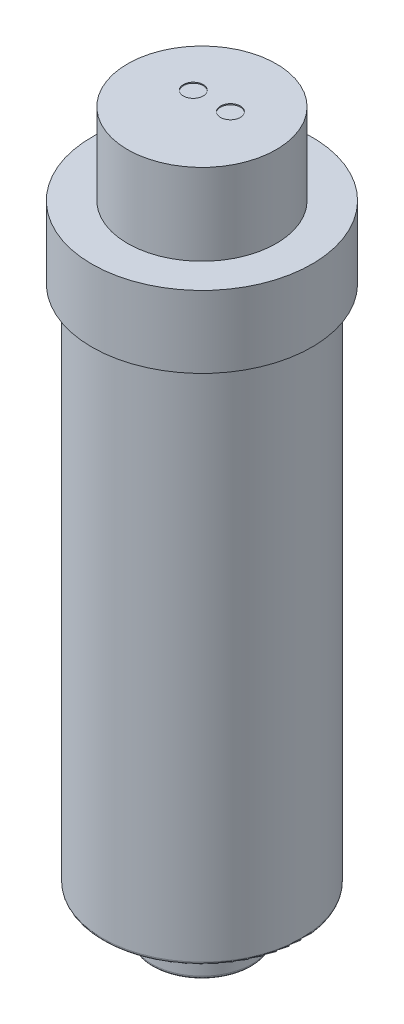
from build123d import *

# Parameters (mm, degrees)
SKETCH1_R           = 25.4254
EXTRUDE1_DEPTH      = 133.35
SKETCH2_R           = 28.194
EXTRUDE2_DEPTH      = 18.415
SKETCH9_R           = 19.05
EXTRUDE6_DEPTH      = 20.828
SKETCH10_R          = 2.54
EXTRUDE7_DEPTH      = 0.254
SKETCH7_R           = 12.7635
EXTRUDE4_DEPTH      = 12.065
EXTRUDE5_DEPTH      = 178.138778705
EXTRUDE5_DEPTH_BACK = 178.138778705
SKETCH8_R           = 3.3401
FILLET1_R           = 0.79375


with BuildPart() as part:
    # Sketch1 → Extrude1 (new body)
    with BuildSketch(Plane(origin=(0, 0, 0), x_dir=(1, 0, 0), z_dir=(0, 1, 0))):
        with Locations(Location((0, 0, 0), (0, 0, 270))):
            Circle(SKETCH1_R)
    extrude(amount=EXTRUDE1_DEPTH)

    # Sketch2 → Extrude2 (add)
    with BuildSketch(Plane(origin=(0, 133.35, 0), x_dir=(-1, 0, 0), z_dir=(0, 1, 0))):
        with Locations(Location((0, 0, 0), (0, 0, 90))):
            Circle(SKETCH2_R)
    extrude(amount=EXTRUDE2_DEPTH)

    # Sketch9 → Extrude6 (add)
    with BuildSketch(Plane(origin=(0, 151.765, 0), x_dir=(1, 0, 0), z_dir=(0, 1, 0))):
        with Locations(Location((0, 0, 0), (0, 0, 270))):
            Circle(SKETCH9_R)
    extrude(amount=EXTRUDE6_DEPTH)

    # Sketch10 → Extrude7 (cut)
    with BuildSketch(Plane(origin=(0, 172.593, 0), x_dir=(1, 0, 0), z_dir=(0, 1, 0))):
        with Locations(Location((-4.7625, 2.54, 0), (0, 0, 270))):
            Circle(SKETCH10_R)
        with Locations(Location((4.7625, 2.54, 0), (0, 0, 270))):
            Circle(SKETCH10_R)
    extrude(amount=-EXTRUDE7_DEPTH, mode=Mode.SUBTRACT)

    # Sketch7 → Extrude4 (add)
    with BuildSketch(Plane.XZ):
        with Locations(Location((0, 0, 0), (0, 0, 90))):
            Circle(SKETCH7_R)
    extrude(amount=EXTRUDE4_DEPTH)

    # Sketch8 → Extrude5 (cut, two sides: drawn at the far end of the back side and taken through both)
    with BuildSketch(Plane.XY.offset(-EXTRUDE5_DEPTH_BACK)):
        with Locations((0, -5.715)):
            Circle(SKETCH8_R)
    extrude(amount=EXTRUDE5_DEPTH + EXTRUDE5_DEPTH_BACK, mode=Mode.SUBTRACT)

    # Fillet1
    fillet1_edges = [part.edges().sort_by_distance(p)[0] for p in [
        (0, 0, -25.4254),
        (0, 0, -12.7635),
        (0, -12.065, -12.7635),
    ]]
    fillet(fillet1_edges, radius=FILLET1_R)


solid = part.part
